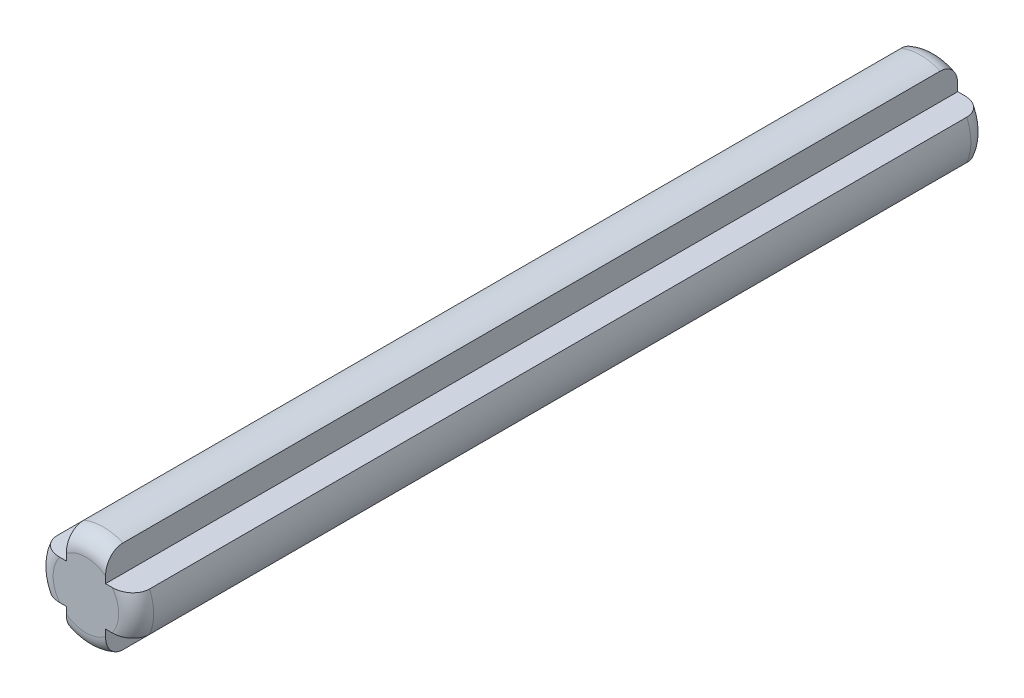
from build123d import *

# Parameters (mm, degrees)
BOSS_EXTRUDE1_DEPTH = 39
FILLET1_R           = 0.8


with BuildPart() as part:
    # Sketch1 → Boss-Extrude1 (new body)
    with BuildSketch(Plane.XY):
        with BuildLine():
            ThreePointArc((0.8999999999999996, 2.116601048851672), (1.4e-16, 2.3), (-0.8999999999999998, 2.116601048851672))
            Line((-0.8999999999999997, 2.1166010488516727), (-0.8999999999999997, 0.8999999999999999))
            Line((-0.8999999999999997, 0.9), (-2.116601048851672, 0.9))
            ThreePointArc((-2.116601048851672, 0.8999999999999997), (-2.3, 2.8e-16), (-2.1166010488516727, -0.8999999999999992))
            Line((-2.116601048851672, -0.9), (-0.8999999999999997, -0.9))
            Line((-0.8999999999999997, -0.8999999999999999), (-0.8999999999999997, -2.1166010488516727))
            ThreePointArc((-0.8999999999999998, -2.116601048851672), (-4.2e-16, -2.3), (0.899999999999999, -2.1166010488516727))
            Line((0.8999999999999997, -2.1166010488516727), (0.8999999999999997, -0.8999999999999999))
            Line((0.8999999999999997, -0.9), (2.116601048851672, -0.9))
            ThreePointArc((2.116601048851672, -0.9), (2.253683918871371, -0.4592480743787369), (2.3, -5.6e-16))
            ThreePointArc((2.3, 0), (2.2536839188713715, 0.4592480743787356), (2.116601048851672, 0.9))
            Line((2.116601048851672, 0.9), (0.8999999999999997, 0.9))
            Line((0.8999999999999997, 0.8999999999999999), (0.8999999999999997, 2.1166010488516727))
        make_face()
    extrude(amount=-BOSS_EXTRUDE1_DEPTH)

    # Fillet1
    fillet1_edges = [part.edges().sort_by_distance(p)[0] for p in [
        (-3.3e-16, 2.3, -39),
        (2.3, -3e-17, 0),
        (-5.3e-16, -2.3000000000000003, 0),
        (-2.3000000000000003, 5.8e-16, 0),
        (-3.3e-16, 2.3, 0),
        (-2.3000000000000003, 5.8e-16, -39),
        (-5.3e-16, -2.3000000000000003, -39),
        (2.3000000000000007, 7e-17, -39),
    ]]
    fillet(fillet1_edges, radius=FILLET1_R)


solid = part.part
